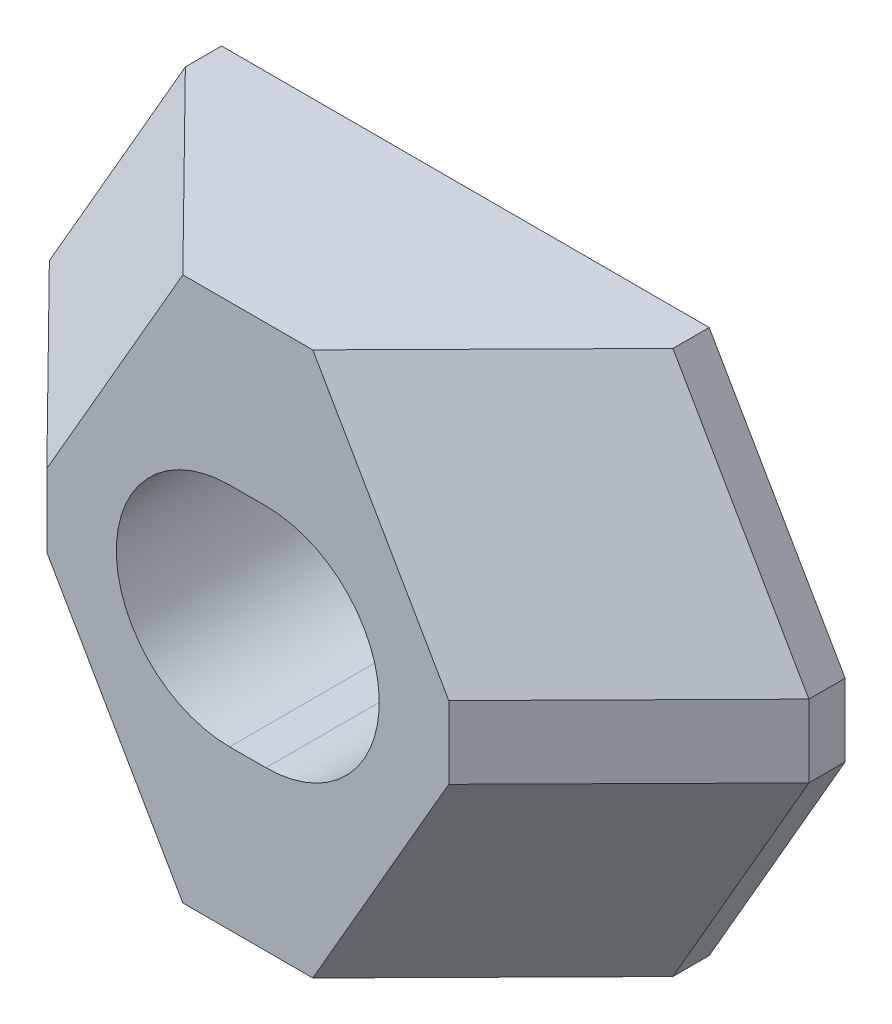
ISO-10303-21;
HEADER;
FILE_DESCRIPTION(('STEP AP214'),'2;1');
FILE_NAME('part.step','',(''),(''),'','','');
FILE_SCHEMA(('AUTOMOTIVE_DESIGN { 1 0 10303 214 1 1 1 1 }'));
ENDSEC;
DATA;
#1=APPLICATION_CONTEXT('core data for automotive mechanical design processes');
#2=APPLICATION_PROTOCOL_DEFINITION('international standard','automotive_design',2000,#1);
#3=PRODUCT_CONTEXT('',#1,'mechanical');
#4=PRODUCT('Part','Part','',(#3));
#5=PRODUCT_RELATED_PRODUCT_CATEGORY('part','',(#4));
#6=PRODUCT_DEFINITION_FORMATION('','',#4);
#7=PRODUCT_DEFINITION_CONTEXT('part definition',#1,'design');
#8=PRODUCT_DEFINITION('design','',#6,#7);
#9=PRODUCT_DEFINITION_SHAPE('','',#8);
#10=(LENGTH_UNIT() NAMED_UNIT(*) SI_UNIT(.MILLI.,.METRE.));
#11=(NAMED_UNIT(*) PLANE_ANGLE_UNIT() SI_UNIT($,.RADIAN.));
#12=(NAMED_UNIT(*) SI_UNIT($,.STERADIAN.) SOLID_ANGLE_UNIT());
#13=UNCERTAINTY_MEASURE_WITH_UNIT(LENGTH_MEASURE(1.E-05),#10,'distance_accuracy_value','');
#14=(GEOMETRIC_REPRESENTATION_CONTEXT(3) GLOBAL_UNCERTAINTY_ASSIGNED_CONTEXT((#13)) GLOBAL_UNIT_ASSIGNED_CONTEXT((#10,
#11,#12)) REPRESENTATION_CONTEXT('',''));
#15=CARTESIAN_POINT('',(0.,0.,0.));
#16=DIRECTION('',(0.,0.,1.));
#17=DIRECTION('',(1.,0.,0.));
#18=AXIS2_PLACEMENT_3D('',#15,#16,#17);
#19=CARTESIAN_POINT('',(-12.2,-15.,0.));
#20=DIRECTION('',(0.,-1.,0.));
#21=DIRECTION('',(1.,0.,0.));
#22=AXIS2_PLACEMENT_3D('',#19,#20,#21);
#23=PLANE('',#22);
#24=DIRECTION('',(0.,0.,1.));
#25=VECTOR('',#24,1.);
#26=CARTESIAN_POINT('',(13.444535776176,-15.,-8.));
#27=LINE('',#26,#25);
#28=CARTESIAN_POINT('',(13.444535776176,-15.,0.));
#29=VERTEX_POINT('',#28);
#30=CARTESIAN_POINT('',(13.444535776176,-15.,2.));
#31=VERTEX_POINT('',#30);
#32=EDGE_CURVE('E237',#29,#31,#27,.T.);
#33=ORIENTED_EDGE('',*,*,#32,.T.);
#34=DIRECTION('',(-0.702153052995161,0.,0.712026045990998));
#35=VECTOR('',#34,1.);
#36=CARTESIAN_POINT('',(1.80119722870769,-15.,13.8070558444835));
#37=LINE('',#36,#35);
#38=CARTESIAN_POINT('',(3.58319633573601,-15.,12.));
#39=VERTEX_POINT('',#38);
#40=EDGE_CURVE('E189',#31,#39,#37,.T.);
#41=ORIENTED_EDGE('',*,*,#40,.T.);
#42=DIRECTION('',(1.,0.,0.));
#43=VECTOR('',#42,1.);
#44=CARTESIAN_POINT('',(-12.2,-15.,12.));
#45=LINE('',#44,#43);
#46=CARTESIAN_POINT('',(-3.583196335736,-15.,12.));
#47=VERTEX_POINT('',#46);
#48=EDGE_CURVE('E164',#39,#47,#45,.F.);
#49=ORIENTED_EDGE('',*,*,#48,.T.);
#50=DIRECTION('',(-0.70215305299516,0.,-0.712026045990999));
#51=VECTOR('',#50,1.);
#52=CARTESIAN_POINT('',(-13.8308586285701,-15.,1.60824505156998));
#53=LINE('',#52,#51);
#54=CARTESIAN_POINT('',(-13.444535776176,-15.,2.));
#55=VERTEX_POINT('',#54);
#56=EDGE_CURVE('E218',#47,#55,#53,.T.);
#57=ORIENTED_EDGE('',*,*,#56,.T.);
#58=DIRECTION('',(0.,0.,1.));
#59=VECTOR('',#58,1.);
#60=CARTESIAN_POINT('',(-13.444535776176,-15.,-8.));
#61=LINE('',#60,#59);
#62=CARTESIAN_POINT('',(-13.444535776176,-15.,0.));
#63=VERTEX_POINT('',#62);
#64=EDGE_CURVE('E233',#63,#55,#61,.T.);
#65=ORIENTED_EDGE('',*,*,#64,.F.);
#66=DIRECTION('',(1.,0.,0.));
#67=VECTOR('',#66,1.);
#68=CARTESIAN_POINT('',(-12.2,-15.,0.));
#69=LINE('',#68,#67);
#70=EDGE_CURVE('E18',#63,#29,#69,.T.);
#71=ORIENTED_EDGE('',*,*,#70,.T.);
#72=EDGE_LOOP('',(#33,#41,#49,#57,#65,#71));
#73=FACE_BOUND('',#72,.T.);
#74=ADVANCED_FACE('F14',(#73),#23,.T.);
#75=CARTESIAN_POINT('',(9.56026786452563,-1.99999999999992,12.));
#76=DIRECTION('',(0.,0.,1.));
#77=DIRECTION('',(1.,0.,0.));
#78=AXIS2_PLACEMENT_3D('',#75,#76,#77);
#79=PLANE('',#78);
#80=CARTESIAN_POINT('',(1.,0.,12.));
#81=DIRECTION('',(0.,0.,1.));
#82=DIRECTION('',(1.,0.,0.));
#83=AXIS2_PLACEMENT_3D('',#80,#81,#82);
#84=CIRCLE('',#83,6.25);
#85=CARTESIAN_POINT('',(1.,-6.25,12.));
#86=VERTEX_POINT('',#85);
#87=CARTESIAN_POINT('',(1.,6.25,12.));
#88=VERTEX_POINT('',#87);
#89=EDGE_CURVE('E273',#86,#88,#84,.T.);
#90=ORIENTED_EDGE('',*,*,#89,.F.);
#91=DIRECTION('',(1.,0.,0.));
#92=VECTOR('',#91,1.);
#93=CARTESIAN_POINT('',(-1.,-6.25,12.));
#94=LINE('',#93,#92);
#95=CARTESIAN_POINT('',(-1.,-6.25,12.));
#96=VERTEX_POINT('',#95);
#97=EDGE_CURVE('E278',#96,#86,#94,.T.);
#98=ORIENTED_EDGE('',*,*,#97,.F.);
#99=CARTESIAN_POINT('',(-1.,0.,12.));
#100=DIRECTION('',(0.,0.,1.));
#101=DIRECTION('',(1.,0.,0.));
#102=AXIS2_PLACEMENT_3D('',#99,#100,#101);
#103=CIRCLE('',#102,6.25);
#104=CARTESIAN_POINT('',(-1.,6.25,12.));
#105=VERTEX_POINT('',#104);
#106=EDGE_CURVE('E292',#105,#96,#103,.T.);
#107=ORIENTED_EDGE('',*,*,#106,.F.);
#108=DIRECTION('',(-1.,0.,0.));
#109=VECTOR('',#108,1.);
#110=CARTESIAN_POINT('',(-1.,6.25,12.));
#111=LINE('',#110,#109);
#112=EDGE_CURVE('E289',#88,#105,#111,.T.);
#113=ORIENTED_EDGE('',*,*,#112,.F.);
#114=EDGE_LOOP('',(#90,#98,#107,#113));
#115=FACE_BOUND('',#114,.T.);
#116=DIRECTION('',(0.,1.,0.));
#117=VECTOR('',#116,1.);
#118=CARTESIAN_POINT('',(11.083196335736,-1.99999999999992,12.));
#119=LINE('',#118,#117);
#120=CARTESIAN_POINT('',(11.083196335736,-2.,12.));
#121=VERTEX_POINT('',#120);
#122=CARTESIAN_POINT('',(11.083196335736,2.,12.));
#123=VERTEX_POINT('',#122);
#124=EDGE_CURVE('E194',#121,#123,#119,.T.);
#125=ORIENTED_EDGE('',*,*,#124,.T.);
#126=DIRECTION('',(-0.499722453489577,0.866185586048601,0.));
#127=VECTOR('',#126,1.);
#128=CARTESIAN_POINT('',(12.4342963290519,-0.341906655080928,12.));
#129=LINE('',#128,#127);
#130=CARTESIAN_POINT('',(3.58319633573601,15.,12.));
#131=VERTEX_POINT('',#130);
#132=EDGE_CURVE('E187',#123,#131,#129,.T.);
#133=ORIENTED_EDGE('',*,*,#132,.T.);
#134=DIRECTION('',(1.,0.,0.));
#135=VECTOR('',#134,1.);
#136=CARTESIAN_POINT('',(9.56026786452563,15.,12.));
#137=LINE('',#136,#135);
#138=CARTESIAN_POINT('',(-3.58319633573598,15.,12.));
#139=VERTEX_POINT('',#138);
#140=EDGE_CURVE('E155',#131,#139,#137,.F.);
#141=ORIENTED_EDGE('',*,*,#140,.T.);
#142=DIRECTION('',(-0.499722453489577,-0.8661855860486,0.));
#143=VECTOR('',#142,1.);
#144=CARTESIAN_POINT('',(-7.65946776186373,7.93446286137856,12.));
#145=LINE('',#144,#143);
#146=CARTESIAN_POINT('',(-11.083196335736,2.,12.));
#147=VERTEX_POINT('',#146);
#148=EDGE_CURVE('E204',#139,#147,#145,.T.);
#149=ORIENTED_EDGE('',*,*,#148,.T.);
#150=DIRECTION('',(0.,-1.,0.));
#151=VECTOR('',#150,1.);
#152=CARTESIAN_POINT('',(-11.083196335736,-1.99999999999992,12.));
#153=LINE('',#152,#151);
#154=CARTESIAN_POINT('',(-11.083196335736,-2.,12.));
#155=VERTEX_POINT('',#154);
#156=EDGE_CURVE('E213',#147,#155,#153,.T.);
#157=ORIENTED_EDGE('',*,*,#156,.T.);
#158=DIRECTION('',(0.499722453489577,-0.866185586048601,0.));
#159=VECTOR('',#158,1.);
#160=CARTESIAN_POINT('',(-5.92805821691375,-10.9355727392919,12.));
#161=LINE('',#160,#159);
#162=EDGE_CURVE('E165',#155,#47,#161,.T.);
#163=ORIENTED_EDGE('',*,*,#162,.T.);
#164=ORIENTED_EDGE('',*,*,#48,.F.);
#165=DIRECTION('',(0.499722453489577,0.866185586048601,0.));
#166=VECTOR('',#165,1.);
#167=CARTESIAN_POINT('',(10.7028867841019,-2.65920322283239,12.));
#168=LINE('',#167,#166);
#169=EDGE_CURVE('E191',#39,#121,#168,.T.);
#170=ORIENTED_EDGE('',*,*,#169,.T.);
#171=EDGE_LOOP('',(#125,#133,#141,#149,#157,#163,#164,#170));
#172=FACE_BOUND('',#171,.T.);
#173=ADVANCED_FACE('F220',(#115,#172),#79,.T.);
#174=CARTESIAN_POINT('',(-12.2,-15.,0.));
#175=DIRECTION('',(0.,0.,-1.));
#176=DIRECTION('',(-1.,0.,0.));
#177=AXIS2_PLACEMENT_3D('',#174,#175,#176);
#178=PLANE('',#177);
#179=DIRECTION('',(-0.499722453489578,0.8661855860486,0.));
#180=VECTOR('',#179,1.);
#181=CARTESIAN_POINT('',(20.026088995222,3.5919744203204,0.));
#182=LINE('',#181,#180);
#183=CARTESIAN_POINT('',(20.944535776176,2.,0.));
#184=VERTEX_POINT('',#183);
#185=CARTESIAN_POINT('',(13.444535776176,15.,0.));
#186=VERTEX_POINT('',#185);
#187=EDGE_CURVE('E138',#184,#186,#182,.T.);
#188=ORIENTED_EDGE('',*,*,#187,.F.);
#189=DIRECTION('',(0.,1.,0.));
#190=VECTOR('',#189,1.);
#191=CARTESIAN_POINT('',(20.944535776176,-15.,0.));
#192=LINE('',#191,#190);
#193=CARTESIAN_POINT('',(20.944535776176,-2.,0.));
#194=VERTEX_POINT('',#193);
#195=EDGE_CURVE('E264',#194,#184,#192,.T.);
#196=ORIENTED_EDGE('',*,*,#195,.F.);
#197=DIRECTION('',(0.499722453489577,0.866185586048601,0.));
#198=VECTOR('',#197,1.);
#199=CARTESIAN_POINT('',(7.04051740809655,-26.1002985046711,0.));
#200=LINE('',#199,#198);
#201=EDGE_CURVE('E142',#29,#194,#200,.T.);
#202=ORIENTED_EDGE('',*,*,#201,.F.);
#203=ORIENTED_EDGE('',*,*,#70,.F.);
#204=DIRECTION('',(0.499722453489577,-0.866185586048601,0.));
#205=VECTOR('',#204,1.);
#206=CARTESIAN_POINT('',(-13.1337471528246,-15.5387002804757,0.));
#207=LINE('',#206,#205);
#208=CARTESIAN_POINT('',(-20.944535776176,-2.,0.));
#209=VERTEX_POINT('',#208);
#210=EDGE_CURVE('E271',#209,#63,#207,.T.);
#211=ORIENTED_EDGE('',*,*,#210,.F.);
#212=DIRECTION('',(0.,-1.,0.));
#213=VECTOR('',#212,1.);
#214=CARTESIAN_POINT('',(-20.944535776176,-15.,0.));
#215=LINE('',#214,#213);
#216=CARTESIAN_POINT('',(-20.944535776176,2.,0.));
#217=VERTEX_POINT('',#216);
#218=EDGE_CURVE('E269',#217,#209,#215,.T.);
#219=ORIENTED_EDGE('',*,*,#218,.F.);
#220=DIRECTION('',(-0.499722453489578,-0.8661855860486,0.));
#221=VECTOR('',#220,1.);
#222=CARTESIAN_POINT('',(-26.1193187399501,-6.96962380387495,0.));
#223=LINE('',#222,#221);
#224=CARTESIAN_POINT('',(-13.444535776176,15.,0.));
#225=VERTEX_POINT('',#224);
#226=EDGE_CURVE('E267',#225,#217,#223,.T.);
#227=ORIENTED_EDGE('',*,*,#226,.F.);
#228=DIRECTION('',(-1.,0.,0.));
#229=VECTOR('',#228,1.);
#230=CARTESIAN_POINT('',(-12.2,15.,0.));
#231=LINE('',#230,#229);
#232=EDGE_CURVE('E161',#225,#186,#231,.F.);
#233=ORIENTED_EDGE('',*,*,#232,.T.);
#234=EDGE_LOOP('',(#188,#196,#202,#203,#211,#219,#227,#233));
#235=FACE_BOUND('',#234,.T.);
#236=CARTESIAN_POINT('',(1.,0.,0.));
#237=DIRECTION('',(0.,0.,1.));
#238=DIRECTION('',(1.,0.,0.));
#239=AXIS2_PLACEMENT_3D('',#236,#237,#238);
#240=CIRCLE('',#239,6.25);
#241=CARTESIAN_POINT('',(1.,-6.25,0.));
#242=VERTEX_POINT('',#241);
#243=CARTESIAN_POINT('',(1.,6.25,0.));
#244=VERTEX_POINT('',#243);
#245=EDGE_CURVE('E274',#242,#244,#240,.T.);
#246=ORIENTED_EDGE('',*,*,#245,.T.);
#247=DIRECTION('',(-1.,0.,0.));
#248=VECTOR('',#247,1.);
#249=CARTESIAN_POINT('',(-1.,6.25,0.));
#250=LINE('',#249,#248);
#251=CARTESIAN_POINT('',(-1.,6.25,0.));
#252=VERTEX_POINT('',#251);
#253=EDGE_CURVE('E277',#244,#252,#250,.T.);
#254=ORIENTED_EDGE('',*,*,#253,.T.);
#255=CARTESIAN_POINT('',(-1.,0.,0.));
#256=DIRECTION('',(0.,0.,1.));
#257=DIRECTION('',(1.,0.,0.));
#258=AXIS2_PLACEMENT_3D('',#255,#256,#257);
#259=CIRCLE('',#258,6.25);
#260=CARTESIAN_POINT('',(-1.,-6.25,0.));
#261=VERTEX_POINT('',#260);
#262=EDGE_CURVE('E281',#252,#261,#259,.T.);
#263=ORIENTED_EDGE('',*,*,#262,.T.);
#264=DIRECTION('',(1.,0.,0.));
#265=VECTOR('',#264,1.);
#266=CARTESIAN_POINT('',(-1.,-6.25,0.));
#267=LINE('',#266,#265);
#268=EDGE_CURVE('E284',#261,#242,#267,.T.);
#269=ORIENTED_EDGE('',*,*,#268,.T.);
#270=EDGE_LOOP('',(#246,#254,#263,#269));
#271=FACE_BOUND('',#270,.T.);
#272=ADVANCED_FACE('F16',(#235,#271),#178,.T.);
#273=CARTESIAN_POINT('',(-12.2,15.,0.));
#274=DIRECTION('',(0.,1.,0.));
#275=DIRECTION('',(1.,0.,0.));
#276=AXIS2_PLACEMENT_3D('',#273,#274,#275);
#277=PLANE('',#276);
#278=DIRECTION('',(0.,0.,1.));
#279=VECTOR('',#278,1.);
#280=CARTESIAN_POINT('',(13.444535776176,15.,-8.));
#281=LINE('',#280,#279);
#282=CARTESIAN_POINT('',(13.444535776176,15.,2.));
#283=VERTEX_POINT('',#282);
#284=EDGE_CURVE('E132',#186,#283,#281,.T.);
#285=ORIENTED_EDGE('',*,*,#284,.F.);
#286=ORIENTED_EDGE('',*,*,#232,.F.);
#287=DIRECTION('',(0.,0.,1.));
#288=VECTOR('',#287,1.);
#289=CARTESIAN_POINT('',(-13.444535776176,15.,-8.));
#290=LINE('',#289,#288);
#291=CARTESIAN_POINT('',(-13.444535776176,15.,2.));
#292=VERTEX_POINT('',#291);
#293=EDGE_CURVE('E252',#225,#292,#290,.T.);
#294=ORIENTED_EDGE('',*,*,#293,.T.);
#295=DIRECTION('',(0.70215305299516,0.,0.712026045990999));
#296=VECTOR('',#295,1.);
#297=CARTESIAN_POINT('',(-13.8308586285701,15.,1.60824505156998));
#298=LINE('',#297,#296);
#299=EDGE_CURVE('E24',#292,#139,#298,.T.);
#300=ORIENTED_EDGE('',*,*,#299,.T.);
#301=ORIENTED_EDGE('',*,*,#140,.F.);
#302=DIRECTION('',(0.702153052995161,0.,-0.712026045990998));
#303=VECTOR('',#302,1.);
#304=CARTESIAN_POINT('',(1.80119722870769,15.,13.8070558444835));
#305=LINE('',#304,#303);
#306=EDGE_CURVE('E9',#131,#283,#305,.T.);
#307=ORIENTED_EDGE('',*,*,#306,.T.);
#308=EDGE_LOOP('',(#285,#286,#294,#300,#301,#307));
#309=FACE_BOUND('',#308,.T.);
#310=ADVANCED_FACE('F153',(#309),#277,.T.);
#311=CARTESIAN_POINT('',(-1.19984639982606,-15.,14.4168622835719));
#312=DIRECTION('',(-0.658622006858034,-0.379974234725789,0.64948951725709));
#313=DIRECTION('',(-0.70215305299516,0.,-0.712026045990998));
#314=AXIS2_PLACEMENT_3D('',#311,#312,#313);
#315=PLANE('',#314);
#316=DIRECTION('',(-0.499722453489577,0.866185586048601,0.));
#317=VECTOR('',#316,1.);
#318=CARTESIAN_POINT('',(-20.944535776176,-2.,2.));
#319=LINE('',#318,#317);
#320=CARTESIAN_POINT('',(-20.944535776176,-2.,2.));
#321=VERTEX_POINT('',#320);
#322=EDGE_CURVE('E229',#55,#321,#319,.T.);
#323=ORIENTED_EDGE('',*,*,#322,.F.);
#324=ORIENTED_EDGE('',*,*,#56,.F.);
#325=ORIENTED_EDGE('',*,*,#162,.F.);
#326=DIRECTION('',(0.702153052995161,0.,0.712026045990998));
#327=VECTOR('',#326,1.);
#328=CARTESIAN_POINT('',(-17.,-2.,6.));
#329=LINE('',#328,#327);
#330=EDGE_CURVE('E203',#321,#155,#329,.T.);
#331=ORIENTED_EDGE('',*,*,#330,.F.);
#332=EDGE_LOOP('',(#323,#324,#325,#331));
#333=FACE_BOUND('',#332,.T.);
#334=ADVANCED_FACE('F227',(#333),#315,.T.);
#335=CARTESIAN_POINT('',(-8.69984639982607,0.,14.4168622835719));
#336=DIRECTION('',(-0.712026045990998,0.,0.702153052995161));
#337=DIRECTION('',(-0.702153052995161,0.,-0.712026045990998));
#338=AXIS2_PLACEMENT_3D('',#335,#336,#337);
#339=PLANE('',#338);
#340=DIRECTION('',(0.,1.,0.));
#341=VECTOR('',#340,1.);
#342=CARTESIAN_POINT('',(-20.944535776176,2.,2.));
#343=LINE('',#342,#341);
#344=CARTESIAN_POINT('',(-20.944535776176,2.,2.));
#345=VERTEX_POINT('',#344);
#346=EDGE_CURVE('E32',#321,#345,#343,.T.);
#347=ORIENTED_EDGE('',*,*,#346,.F.);
#348=ORIENTED_EDGE('',*,*,#330,.T.);
#349=ORIENTED_EDGE('',*,*,#156,.F.);
#350=DIRECTION('',(0.702153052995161,0.,0.712026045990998));
#351=VECTOR('',#350,1.);
#352=CARTESIAN_POINT('',(-17.,2.,6.));
#353=LINE('',#352,#351);
#354=EDGE_CURVE('E197',#345,#147,#353,.T.);
#355=ORIENTED_EDGE('',*,*,#354,.F.);
#356=EDGE_LOOP('',(#347,#348,#349,#355));
#357=FACE_BOUND('',#356,.T.);
#358=ADVANCED_FACE('F214',(#357),#339,.T.);
#359=CARTESIAN_POINT('',(-1.19984639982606,15.,14.4168622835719));
#360=DIRECTION('',(-0.658622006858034,0.379974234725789,0.64948951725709));
#361=DIRECTION('',(-0.70215305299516,0.,-0.712026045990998));
#362=AXIS2_PLACEMENT_3D('',#359,#360,#361);
#363=PLANE('',#362);
#364=DIRECTION('',(0.499722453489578,0.8661855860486,0.));
#365=VECTOR('',#364,1.);
#366=CARTESIAN_POINT('',(-13.444535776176,15.,2.));
#367=LINE('',#366,#365);
#368=EDGE_CURVE('E210',#345,#292,#367,.T.);
#369=ORIENTED_EDGE('',*,*,#368,.F.);
#370=ORIENTED_EDGE('',*,*,#354,.T.);
#371=ORIENTED_EDGE('',*,*,#148,.F.);
#372=ORIENTED_EDGE('',*,*,#299,.F.);
#373=EDGE_LOOP('',(#369,#370,#371,#372));
#374=FACE_BOUND('',#373,.T.);
#375=ADVANCED_FACE('F209',(#374),#363,.T.);
#376=CARTESIAN_POINT('',(1.19984639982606,15.,14.4168622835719));
#377=DIRECTION('',(0.658622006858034,0.379974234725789,0.64948951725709));
#378=DIRECTION('',(0.70215305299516,0.,-0.712026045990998));
#379=AXIS2_PLACEMENT_3D('',#376,#377,#378);
#380=PLANE('',#379);
#381=DIRECTION('',(0.499722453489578,-0.8661855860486,0.));
#382=VECTOR('',#381,1.);
#383=CARTESIAN_POINT('',(13.444535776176,15.,2.));
#384=LINE('',#383,#382);
#385=CARTESIAN_POINT('',(20.944535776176,2.,2.));
#386=VERTEX_POINT('',#385);
#387=EDGE_CURVE('E136',#283,#386,#384,.T.);
#388=ORIENTED_EDGE('',*,*,#387,.F.);
#389=ORIENTED_EDGE('',*,*,#306,.F.);
#390=ORIENTED_EDGE('',*,*,#132,.F.);
#391=DIRECTION('',(-0.702153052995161,0.,0.712026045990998));
#392=VECTOR('',#391,1.);
#393=CARTESIAN_POINT('',(17.,2.,6.));
#394=LINE('',#393,#392);
#395=EDGE_CURVE('E150',#386,#123,#394,.T.);
#396=ORIENTED_EDGE('',*,*,#395,.F.);
#397=EDGE_LOOP('',(#388,#389,#390,#396));
#398=FACE_BOUND('',#397,.T.);
#399=ADVANCED_FACE('F147',(#398),#380,.T.);
#400=CARTESIAN_POINT('',(8.69984639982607,0.,14.4168622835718));
#401=DIRECTION('',(0.712026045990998,0.,0.702153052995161));
#402=DIRECTION('',(0.702153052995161,0.,-0.712026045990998));
#403=AXIS2_PLACEMENT_3D('',#400,#401,#402);
#404=PLANE('',#403);
#405=DIRECTION('',(0.,-1.,0.));
#406=VECTOR('',#405,1.);
#407=CARTESIAN_POINT('',(20.944535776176,2.,2.));
#408=LINE('',#407,#406);
#409=CARTESIAN_POINT('',(20.944535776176,-2.,2.));
#410=VERTEX_POINT('',#409);
#411=EDGE_CURVE('E40',#386,#410,#408,.T.);
#412=ORIENTED_EDGE('',*,*,#411,.F.);
#413=ORIENTED_EDGE('',*,*,#395,.T.);
#414=ORIENTED_EDGE('',*,*,#124,.F.);
#415=DIRECTION('',(-0.702153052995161,0.,0.712026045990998));
#416=VECTOR('',#415,1.);
#417=CARTESIAN_POINT('',(17.,-2.,6.));
#418=LINE('',#417,#416);
#419=EDGE_CURVE('E177',#410,#121,#418,.T.);
#420=ORIENTED_EDGE('',*,*,#419,.F.);
#421=EDGE_LOOP('',(#412,#413,#414,#420));
#422=FACE_BOUND('',#421,.T.);
#423=ADVANCED_FACE('F244',(#422),#404,.T.);
#424=CARTESIAN_POINT('',(1.19984639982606,-15.,14.4168622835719));
#425=DIRECTION('',(0.658622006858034,-0.379974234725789,0.64948951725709));
#426=DIRECTION('',(0.70215305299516,0.,-0.712026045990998));
#427=AXIS2_PLACEMENT_3D('',#424,#425,#426);
#428=PLANE('',#427);
#429=DIRECTION('',(-0.499722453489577,-0.866185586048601,0.));
#430=VECTOR('',#429,1.);
#431=CARTESIAN_POINT('',(20.944535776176,-2.,2.));
#432=LINE('',#431,#430);
#433=EDGE_CURVE('E245',#410,#31,#432,.T.);
#434=ORIENTED_EDGE('',*,*,#433,.F.);
#435=ORIENTED_EDGE('',*,*,#419,.T.);
#436=ORIENTED_EDGE('',*,*,#169,.F.);
#437=ORIENTED_EDGE('',*,*,#40,.F.);
#438=EDGE_LOOP('',(#434,#435,#436,#437));
#439=FACE_BOUND('',#438,.T.);
#440=ADVANCED_FACE('F240',(#439),#428,.T.);
#441=CARTESIAN_POINT('',(1.,0.,0.));
#442=DIRECTION('',(0.,0.,1.));
#443=DIRECTION('',(1.,0.,0.));
#444=AXIS2_PLACEMENT_3D('',#441,#442,#443);
#445=CYLINDRICAL_SURFACE('',#444,6.25);
#446=ORIENTED_EDGE('',*,*,#89,.T.);
#447=DIRECTION('',(0.,0.,1.));
#448=VECTOR('',#447,1.);
#449=CARTESIAN_POINT('',(1.,6.25,0.));
#450=LINE('',#449,#448);
#451=EDGE_CURVE('E287',#244,#88,#450,.T.);
#452=ORIENTED_EDGE('',*,*,#451,.F.);
#453=ORIENTED_EDGE('',*,*,#245,.F.);
#454=DIRECTION('',(0.,0.,1.));
#455=VECTOR('',#454,1.);
#456=CARTESIAN_POINT('',(1.,-6.25,0.));
#457=LINE('',#456,#455);
#458=EDGE_CURVE('E180',#242,#86,#457,.T.);
#459=ORIENTED_EDGE('',*,*,#458,.T.);
#460=EDGE_LOOP('',(#446,#452,#453,#459));
#461=FACE_BOUND('',#460,.T.);
#462=ADVANCED_FACE('F317',(#461),#445,.F.);
#463=CARTESIAN_POINT('',(-1.,-6.25,0.));
#464=DIRECTION('',(0.,-1.,0.));
#465=DIRECTION('',(0.,0.,-1.));
#466=AXIS2_PLACEMENT_3D('',#463,#464,#465);
#467=PLANE('',#466);
#468=ORIENTED_EDGE('',*,*,#97,.T.);
#469=ORIENTED_EDGE('',*,*,#458,.F.);
#470=ORIENTED_EDGE('',*,*,#268,.F.);
#471=DIRECTION('',(0.,0.,1.));
#472=VECTOR('',#471,1.);
#473=CARTESIAN_POINT('',(-1.,-6.25,0.));
#474=LINE('',#473,#472);
#475=EDGE_CURVE('E298',#261,#96,#474,.T.);
#476=ORIENTED_EDGE('',*,*,#475,.T.);
#477=EDGE_LOOP('',(#468,#469,#470,#476));
#478=FACE_BOUND('',#477,.T.);
#479=ADVANCED_FACE('F319',(#478),#467,.F.);
#480=CARTESIAN_POINT('',(-1.,0.,0.));
#481=DIRECTION('',(0.,0.,1.));
#482=DIRECTION('',(1.,0.,0.));
#483=AXIS2_PLACEMENT_3D('',#480,#481,#482);
#484=CYLINDRICAL_SURFACE('',#483,6.25);
#485=ORIENTED_EDGE('',*,*,#106,.T.);
#486=ORIENTED_EDGE('',*,*,#475,.F.);
#487=ORIENTED_EDGE('',*,*,#262,.F.);
#488=DIRECTION('',(0.,0.,1.));
#489=VECTOR('',#488,1.);
#490=CARTESIAN_POINT('',(-1.,6.25,0.));
#491=LINE('',#490,#489);
#492=EDGE_CURVE('E300',#252,#105,#491,.T.);
#493=ORIENTED_EDGE('',*,*,#492,.T.);
#494=EDGE_LOOP('',(#485,#486,#487,#493));
#495=FACE_BOUND('',#494,.T.);
#496=ADVANCED_FACE('F314',(#495),#484,.F.);
#497=CARTESIAN_POINT('',(-1.,6.25,0.));
#498=DIRECTION('',(0.,1.,0.));
#499=DIRECTION('',(-1.,0.,0.));
#500=AXIS2_PLACEMENT_3D('',#497,#498,#499);
#501=PLANE('',#500);
#502=ORIENTED_EDGE('',*,*,#112,.T.);
#503=ORIENTED_EDGE('',*,*,#492,.F.);
#504=ORIENTED_EDGE('',*,*,#253,.F.);
#505=ORIENTED_EDGE('',*,*,#451,.T.);
#506=EDGE_LOOP('',(#502,#503,#504,#505));
#507=FACE_BOUND('',#506,.T.);
#508=ADVANCED_FACE('F305',(#507),#501,.F.);
#509=CARTESIAN_POINT('',(20.944535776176,-2.,-8.));
#510=DIRECTION('',(-0.866185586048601,0.499722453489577,0.));
#511=DIRECTION('',(-0.499722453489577,-0.866185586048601,0.));
#512=AXIS2_PLACEMENT_3D('',#509,#510,#511);
#513=PLANE('',#512);
#514=ORIENTED_EDGE('',*,*,#201,.T.);
#515=DIRECTION('',(0.,0.,1.));
#516=VECTOR('',#515,1.);
#517=CARTESIAN_POINT('',(20.944535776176,-2.,-8.));
#518=LINE('',#517,#516);
#519=EDGE_CURVE('E260',#194,#410,#518,.T.);
#520=ORIENTED_EDGE('',*,*,#519,.T.);
#521=ORIENTED_EDGE('',*,*,#433,.T.);
#522=ORIENTED_EDGE('',*,*,#32,.F.);
#523=EDGE_LOOP('',(#514,#520,#521,#522));
#524=FACE_BOUND('',#523,.T.);
#525=ADVANCED_FACE('F353',(#524),#513,.F.);
#526=CARTESIAN_POINT('',(20.944535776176,2.,-8.));
#527=DIRECTION('',(-1.,0.,0.));
#528=DIRECTION('',(0.,-1.,0.));
#529=AXIS2_PLACEMENT_3D('',#526,#527,#528);
#530=PLANE('',#529);
#531=ORIENTED_EDGE('',*,*,#195,.T.);
#532=DIRECTION('',(0.,0.,1.));
#533=VECTOR('',#532,1.);
#534=CARTESIAN_POINT('',(20.944535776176,2.,-8.));
#535=LINE('',#534,#533);
#536=EDGE_CURVE('E143',#184,#386,#535,.T.);
#537=ORIENTED_EDGE('',*,*,#536,.T.);
#538=ORIENTED_EDGE('',*,*,#411,.T.);
#539=ORIENTED_EDGE('',*,*,#519,.F.);
#540=EDGE_LOOP('',(#531,#537,#538,#539));
#541=FACE_BOUND('',#540,.T.);
#542=ADVANCED_FACE('F358',(#541),#530,.F.);
#543=CARTESIAN_POINT('',(13.444535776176,15.,-8.));
#544=DIRECTION('',(-0.8661855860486,-0.499722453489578,0.));
#545=DIRECTION('',(0.499722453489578,-0.8661855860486,0.));
#546=AXIS2_PLACEMENT_3D('',#543,#544,#545);
#547=PLANE('',#546);
#548=ORIENTED_EDGE('',*,*,#187,.T.);
#549=ORIENTED_EDGE('',*,*,#284,.T.);
#550=ORIENTED_EDGE('',*,*,#387,.T.);
#551=ORIENTED_EDGE('',*,*,#536,.F.);
#552=EDGE_LOOP('',(#548,#549,#550,#551));
#553=FACE_BOUND('',#552,.T.);
#554=ADVANCED_FACE('F134',(#553),#547,.F.);
#555=CARTESIAN_POINT('',(-20.944535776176,-2.,-8.));
#556=DIRECTION('',(0.866185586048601,0.499722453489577,0.));
#557=DIRECTION('',(-0.499722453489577,0.866185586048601,0.));
#558=AXIS2_PLACEMENT_3D('',#555,#556,#557);
#559=PLANE('',#558);
#560=ORIENTED_EDGE('',*,*,#210,.T.);
#561=ORIENTED_EDGE('',*,*,#64,.T.);
#562=ORIENTED_EDGE('',*,*,#322,.T.);
#563=DIRECTION('',(0.,0.,1.));
#564=VECTOR('',#563,1.);
#565=CARTESIAN_POINT('',(-20.944535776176,-2.,-8.));
#566=LINE('',#565,#564);
#567=EDGE_CURVE('E256',#209,#321,#566,.T.);
#568=ORIENTED_EDGE('',*,*,#567,.F.);
#569=EDGE_LOOP('',(#560,#561,#562,#568));
#570=FACE_BOUND('',#569,.T.);
#571=ADVANCED_FACE('F367',(#570),#559,.F.);
#572=CARTESIAN_POINT('',(-20.944535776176,2.,-8.));
#573=DIRECTION('',(1.,0.,0.));
#574=DIRECTION('',(0.,1.,0.));
#575=AXIS2_PLACEMENT_3D('',#572,#573,#574);
#576=PLANE('',#575);
#577=ORIENTED_EDGE('',*,*,#218,.T.);
#578=ORIENTED_EDGE('',*,*,#567,.T.);
#579=ORIENTED_EDGE('',*,*,#346,.T.);
#580=DIRECTION('',(0.,0.,1.));
#581=VECTOR('',#580,1.);
#582=CARTESIAN_POINT('',(-20.944535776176,2.,-8.));
#583=LINE('',#582,#581);
#584=EDGE_CURVE('E254',#217,#345,#583,.T.);
#585=ORIENTED_EDGE('',*,*,#584,.F.);
#586=EDGE_LOOP('',(#577,#578,#579,#585));
#587=FACE_BOUND('',#586,.T.);
#588=ADVANCED_FACE('F374',(#587),#576,.F.);
#589=CARTESIAN_POINT('',(-13.444535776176,15.,-8.));
#590=DIRECTION('',(0.8661855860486,-0.499722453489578,0.));
#591=DIRECTION('',(0.499722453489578,0.8661855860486,0.));
#592=AXIS2_PLACEMENT_3D('',#589,#590,#591);
#593=PLANE('',#592);
#594=ORIENTED_EDGE('',*,*,#226,.T.);
#595=ORIENTED_EDGE('',*,*,#584,.T.);
#596=ORIENTED_EDGE('',*,*,#368,.T.);
#597=ORIENTED_EDGE('',*,*,#293,.F.);
#598=EDGE_LOOP('',(#594,#595,#596,#597));
#599=FACE_BOUND('',#598,.T.);
#600=ADVANCED_FACE('F380',(#599),#593,.F.);
#601=CLOSED_SHELL('',(#74,#173,#272,#310,#334,#358,#375,#399,#423,#440,#462,#479,#496,#508,#525,
#542,#554,#571,#588,#600));
#602=MANIFOLD_SOLID_BREP('B1',#601);
#603=ADVANCED_BREP_SHAPE_REPRESENTATION('',(#18,#602),#14);
#604=SHAPE_DEFINITION_REPRESENTATION(#9,#603);
ENDSEC;
END-ISO-10303-21;
